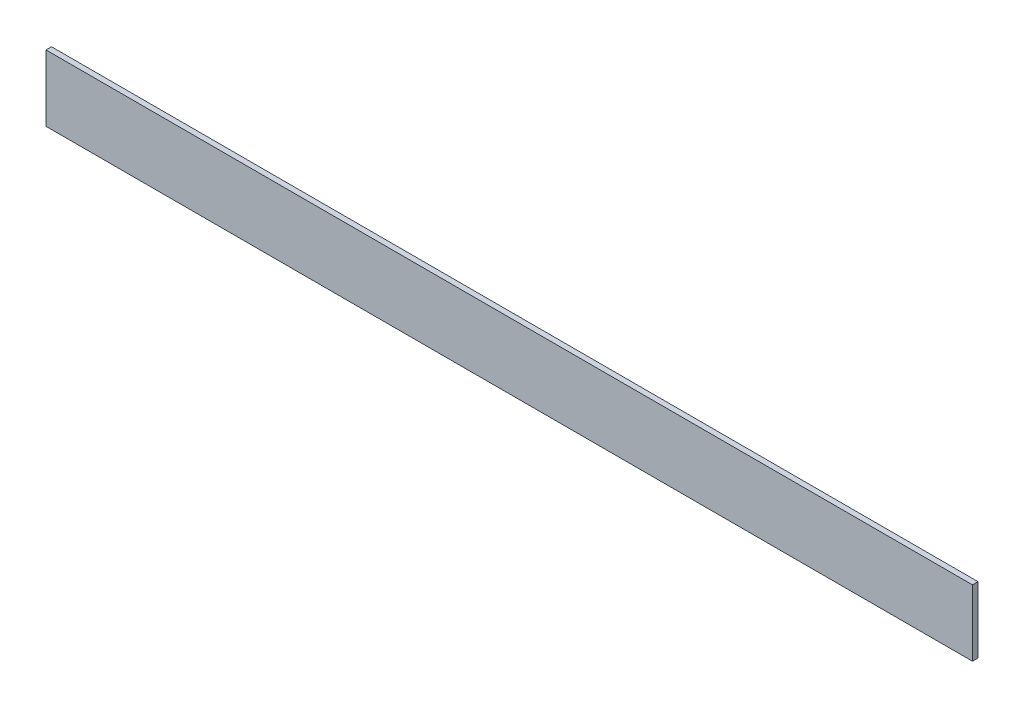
from build123d import *

# Parameters (mm, degrees)
SKETCH1_W           = 1066.8
SKETCH1_H           = 76.2
BOSS_EXTRUDE1_DEPTH = 6.35


with BuildPart() as part:
    # Sketch1 → Boss-Extrude1 (new body)
    with BuildSketch(Plane.XY):
        Rectangle(SKETCH1_W, SKETCH1_H)
    extrude(amount=BOSS_EXTRUDE1_DEPTH)


solid = part.part
